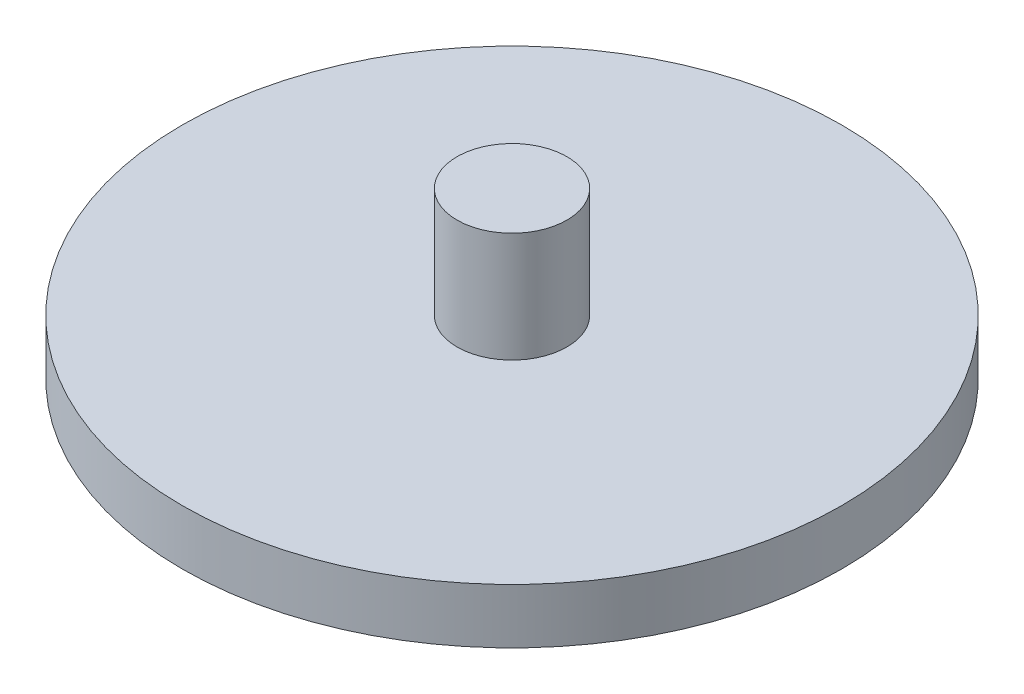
from build123d import *

# Parameters (mm, degrees)
SKETCH1_R           = 25.4
BOSS_EXTRUDE1_DEPTH = 50.8
SKETCH2_R           = 152.4
BOSS_EXTRUDE2_DEPTH = 25.4
BOSS_EXTRUDE3_DEPTH = 55.88
SKETCH4_R           = 20.32
CUT_EXTRUDE1_DEPTH  = 277.486904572


with BuildPart() as part:
    # Sketch1 → Boss-Extrude1 (new body)
    with BuildSketch(Plane(origin=(0, 0, 0), x_dir=(1, 0, 0), z_dir=(0, 1, 0))):
        with Locations(Location((0, 0, 0), (0, 0, 270))):
            Circle(SKETCH1_R)
    extrude(amount=BOSS_EXTRUDE1_DEPTH)

    # Sketch2 → Boss-Extrude2 (add)
    with BuildSketch(Plane.XZ):
        with Locations(Location((0, 0, 0), (0, 0, 270))):
            Circle(SKETCH2_R)
    extrude(amount=BOSS_EXTRUDE2_DEPTH)

    # Sketch3 → Boss-Extrude3 (add)
    with BuildSketch(Plane.XZ.offset(25.4)):
        Polygon((-63.5, 27.94), (-63.5, 0), (63.5, 0), (63.5, 3.216844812), (63.5, 27.94), align=None)
        Polygon((63.5, 0), (-63.5, 0), (-63.5, -27.94), (63.5, -27.94), (63.5, -3.216844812), align=None)
    extrude(amount=BOSS_EXTRUDE3_DEPTH)

    # Sketch4 → Cut-Extrude1 (cut, through all)
    with BuildSketch(Plane.ZY.offset(63.5)):
        with Locations((0, -53.34)):
            Circle(SKETCH4_R)
    extrude(amount=-CUT_EXTRUDE1_DEPTH, mode=Mode.SUBTRACT)


solid = part.part
